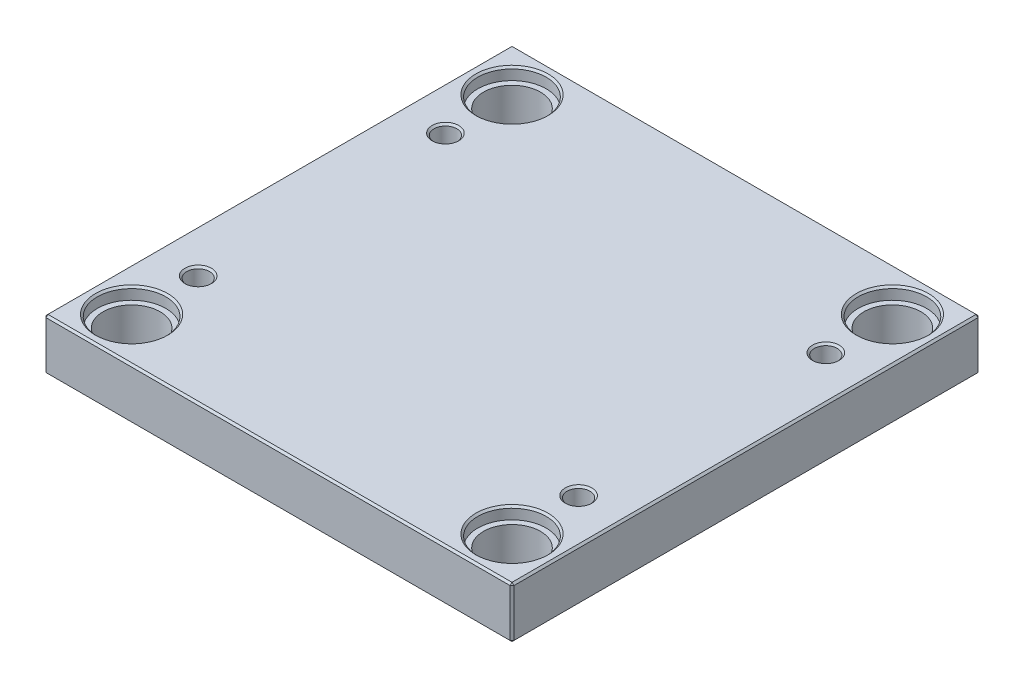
ISO-10303-21;
HEADER;
FILE_DESCRIPTION(('STEP AP214'),'2;1');
FILE_NAME('part.step','',(''),(''),'','','');
FILE_SCHEMA(('AUTOMOTIVE_DESIGN { 1 0 10303 214 1 1 1 1 }'));
ENDSEC;
DATA;
#1=APPLICATION_CONTEXT('core data for automotive mechanical design processes');
#2=APPLICATION_PROTOCOL_DEFINITION('international standard','automotive_design',2000,#1);
#3=PRODUCT_CONTEXT('',#1,'mechanical');
#4=PRODUCT('Part','Part','',(#3));
#5=PRODUCT_RELATED_PRODUCT_CATEGORY('part','',(#4));
#6=PRODUCT_DEFINITION_FORMATION('','',#4);
#7=PRODUCT_DEFINITION_CONTEXT('part definition',#1,'design');
#8=PRODUCT_DEFINITION('design','',#6,#7);
#9=PRODUCT_DEFINITION_SHAPE('','',#8);
#10=(LENGTH_UNIT() NAMED_UNIT(*) SI_UNIT(.MILLI.,.METRE.));
#11=(NAMED_UNIT(*) PLANE_ANGLE_UNIT() SI_UNIT($,.RADIAN.));
#12=(NAMED_UNIT(*) SI_UNIT($,.STERADIAN.) SOLID_ANGLE_UNIT());
#13=UNCERTAINTY_MEASURE_WITH_UNIT(LENGTH_MEASURE(1.E-05),#10,'distance_accuracy_value','');
#14=(GEOMETRIC_REPRESENTATION_CONTEXT(3) GLOBAL_UNCERTAINTY_ASSIGNED_CONTEXT((#13)) GLOBAL_UNIT_ASSIGNED_CONTEXT((#10,
#11,#12)) REPRESENTATION_CONTEXT('',''));
#15=CARTESIAN_POINT('',(0.,0.,0.));
#16=DIRECTION('',(0.,0.,1.));
#17=DIRECTION('',(1.,0.,0.));
#18=AXIS2_PLACEMENT_3D('',#15,#16,#17);
#19=CARTESIAN_POINT('',(-100.,0.,-100.));
#20=DIRECTION('',(0.,1.,0.));
#21=DIRECTION('',(0.,0.,1.));
#22=AXIS2_PLACEMENT_3D('',#19,#20,#21);
#23=CYLINDRICAL_SURFACE('',#22,15.);
#24=CARTESIAN_POINT('',(-100.,1.,-100.));
#25=DIRECTION('',(0.,1.,0.));
#26=DIRECTION('',(0.,0.,1.));
#27=AXIS2_PLACEMENT_3D('',#24,#25,#26);
#28=CIRCLE('',#27,15.);
#29=CARTESIAN_POINT('',(-100.,1.,-85.));
#30=VERTEX_POINT('',#29);
#31=EDGE_CURVE('E472',#30,#30,#28,.F.);
#32=ORIENTED_EDGE('',*,*,#31,.T.);
#33=EDGE_LOOP('',(#32));
#34=FACE_BOUND('',#33,.T.);
#35=CARTESIAN_POINT('',(-100.,20.7,-100.));
#36=DIRECTION('',(0.,1.,0.));
#37=DIRECTION('',(0.,0.,1.));
#38=AXIS2_PLACEMENT_3D('',#35,#36,#37);
#39=CIRCLE('',#38,15.);
#40=CARTESIAN_POINT('',(-100.,20.7,-85.));
#41=VERTEX_POINT('',#40);
#42=EDGE_CURVE('E221',#41,#41,#39,.F.);
#43=ORIENTED_EDGE('',*,*,#42,.F.);
#44=EDGE_LOOP('',(#43));
#45=FACE_BOUND('',#44,.T.);
#46=ADVANCED_FACE('F16',(#34,#45),#23,.F.);
#47=CARTESIAN_POINT('',(100.,0.,-100.));
#48=DIRECTION('',(0.,1.,0.));
#49=DIRECTION('',(0.,0.,1.));
#50=AXIS2_PLACEMENT_3D('',#47,#48,#49);
#51=CYLINDRICAL_SURFACE('',#50,15.);
#52=CARTESIAN_POINT('',(100.,1.,-100.));
#53=DIRECTION('',(0.,1.,0.));
#54=DIRECTION('',(0.,0.,1.));
#55=AXIS2_PLACEMENT_3D('',#52,#53,#54);
#56=CIRCLE('',#55,15.);
#57=CARTESIAN_POINT('',(100.,1.,-85.));
#58=VERTEX_POINT('',#57);
#59=EDGE_CURVE('E474',#58,#58,#56,.F.);
#60=ORIENTED_EDGE('',*,*,#59,.T.);
#61=EDGE_LOOP('',(#60));
#62=FACE_BOUND('',#61,.T.);
#63=CARTESIAN_POINT('',(100.,20.7,-100.));
#64=DIRECTION('',(0.,1.,0.));
#65=DIRECTION('',(0.,0.,1.));
#66=AXIS2_PLACEMENT_3D('',#63,#64,#65);
#67=CIRCLE('',#66,15.);
#68=CARTESIAN_POINT('',(100.,20.7,-85.));
#69=VERTEX_POINT('',#68);
#70=EDGE_CURVE('E218',#69,#69,#67,.F.);
#71=ORIENTED_EDGE('',*,*,#70,.F.);
#72=EDGE_LOOP('',(#71));
#73=FACE_BOUND('',#72,.T.);
#74=ADVANCED_FACE('F263',(#62,#73),#51,.F.);
#75=CARTESIAN_POINT('',(100.,0.,100.));
#76=DIRECTION('',(0.,1.,0.));
#77=DIRECTION('',(0.,0.,1.));
#78=AXIS2_PLACEMENT_3D('',#75,#76,#77);
#79=CYLINDRICAL_SURFACE('',#78,15.);
#80=CARTESIAN_POINT('',(100.,1.,100.));
#81=DIRECTION('',(0.,1.,0.));
#82=DIRECTION('',(0.,0.,1.));
#83=AXIS2_PLACEMENT_3D('',#80,#81,#82);
#84=CIRCLE('',#83,15.);
#85=CARTESIAN_POINT('',(100.,1.,115.));
#86=VERTEX_POINT('',#85);
#87=EDGE_CURVE('E477',#86,#86,#84,.F.);
#88=ORIENTED_EDGE('',*,*,#87,.T.);
#89=EDGE_LOOP('',(#88));
#90=FACE_BOUND('',#89,.T.);
#91=CARTESIAN_POINT('',(100.,20.7,100.));
#92=DIRECTION('',(0.,1.,0.));
#93=DIRECTION('',(0.,0.,1.));
#94=AXIS2_PLACEMENT_3D('',#91,#92,#93);
#95=CIRCLE('',#94,15.);
#96=CARTESIAN_POINT('',(100.,20.7,115.));
#97=VERTEX_POINT('',#96);
#98=EDGE_CURVE('E214',#97,#97,#95,.F.);
#99=ORIENTED_EDGE('',*,*,#98,.F.);
#100=EDGE_LOOP('',(#99));
#101=FACE_BOUND('',#100,.T.);
#102=ADVANCED_FACE('F270',(#90,#101),#79,.F.);
#103=CARTESIAN_POINT('',(-100.,0.,100.));
#104=DIRECTION('',(0.,1.,0.));
#105=DIRECTION('',(0.,0.,1.));
#106=AXIS2_PLACEMENT_3D('',#103,#104,#105);
#107=CYLINDRICAL_SURFACE('',#106,15.);
#108=CARTESIAN_POINT('',(-100.,1.,100.));
#109=DIRECTION('',(0.,1.,0.));
#110=DIRECTION('',(0.,0.,1.));
#111=AXIS2_PLACEMENT_3D('',#108,#109,#110);
#112=CIRCLE('',#111,15.);
#113=CARTESIAN_POINT('',(-100.,1.,115.));
#114=VERTEX_POINT('',#113);
#115=EDGE_CURVE('E480',#114,#114,#112,.F.);
#116=ORIENTED_EDGE('',*,*,#115,.T.);
#117=EDGE_LOOP('',(#116));
#118=FACE_BOUND('',#117,.T.);
#119=CARTESIAN_POINT('',(-100.,20.7,100.));
#120=DIRECTION('',(0.,1.,0.));
#121=DIRECTION('',(0.,0.,1.));
#122=AXIS2_PLACEMENT_3D('',#119,#120,#121);
#123=CIRCLE('',#122,15.);
#124=CARTESIAN_POINT('',(-100.,20.7,115.));
#125=VERTEX_POINT('',#124);
#126=EDGE_CURVE('E211',#125,#125,#123,.F.);
#127=ORIENTED_EDGE('',*,*,#126,.F.);
#128=EDGE_LOOP('',(#127));
#129=FACE_BOUND('',#128,.T.);
#130=ADVANCED_FACE('F277',(#118,#129),#107,.F.);
#131=CARTESIAN_POINT('',(-123.,27.,123.));
#132=DIRECTION('',(1.,0.,0.));
#133=DIRECTION('',(0.,0.,-1.));
#134=AXIS2_PLACEMENT_3D('',#131,#132,#133);
#135=PLANE('',#134);
#136=DIRECTION('',(0.,-1.,0.));
#137=VECTOR('',#136,1.);
#138=CARTESIAN_POINT('',(-123.,27.,-122.));
#139=LINE('',#138,#137);
#140=CARTESIAN_POINT('',(-123.,26.,-122.));
#141=VERTEX_POINT('',#140);
#142=CARTESIAN_POINT('',(-123.,1.,-122.));
#143=VERTEX_POINT('',#142);
#144=EDGE_CURVE('E487',#141,#143,#139,.T.);
#145=ORIENTED_EDGE('',*,*,#144,.T.);
#146=DIRECTION('',(0.,0.,1.));
#147=VECTOR('',#146,1.);
#148=CARTESIAN_POINT('',(-123.,1.,123.));
#149=LINE('',#148,#147);
#150=CARTESIAN_POINT('',(-123.,1.,122.));
#151=VERTEX_POINT('',#150);
#152=EDGE_CURVE('E490',#143,#151,#149,.T.);
#153=ORIENTED_EDGE('',*,*,#152,.T.);
#154=DIRECTION('',(0.,1.,0.));
#155=VECTOR('',#154,1.);
#156=CARTESIAN_POINT('',(-123.,27.,122.));
#157=LINE('',#156,#155);
#158=CARTESIAN_POINT('',(-123.,26.,122.));
#159=VERTEX_POINT('',#158);
#160=EDGE_CURVE('E485',#151,#159,#157,.T.);
#161=ORIENTED_EDGE('',*,*,#160,.T.);
#162=DIRECTION('',(0.,0.,-1.));
#163=VECTOR('',#162,1.);
#164=CARTESIAN_POINT('',(-123.,26.,-123.));
#165=LINE('',#164,#163);
#166=EDGE_CURVE('E483',#159,#141,#165,.T.);
#167=ORIENTED_EDGE('',*,*,#166,.T.);
#168=EDGE_LOOP('',(#145,#153,#161,#167));
#169=FACE_BOUND('',#168,.T.);
#170=ADVANCED_FACE('F298',(#169),#135,.F.);
#171=CARTESIAN_POINT('',(123.,27.,123.));
#172=DIRECTION('',(0.,0.,-1.));
#173=DIRECTION('',(-1.,0.,0.));
#174=AXIS2_PLACEMENT_3D('',#171,#172,#173);
#175=PLANE('',#174);
#176=DIRECTION('',(-1.,0.,0.));
#177=VECTOR('',#176,1.);
#178=CARTESIAN_POINT('',(-123.,26.,123.));
#179=LINE('',#178,#177);
#180=CARTESIAN_POINT('',(122.,26.,123.));
#181=VERTEX_POINT('',#180);
#182=CARTESIAN_POINT('',(-122.,26.,123.));
#183=VERTEX_POINT('',#182);
#184=EDGE_CURVE('E509',#181,#183,#179,.T.);
#185=ORIENTED_EDGE('',*,*,#184,.T.);
#186=DIRECTION('',(0.,-1.,0.));
#187=VECTOR('',#186,1.);
#188=CARTESIAN_POINT('',(-122.,27.,123.));
#189=LINE('',#188,#187);
#190=CARTESIAN_POINT('',(-122.,1.,123.));
#191=VERTEX_POINT('',#190);
#192=EDGE_CURVE('E515',#183,#191,#189,.T.);
#193=ORIENTED_EDGE('',*,*,#192,.T.);
#194=DIRECTION('',(1.,0.,0.));
#195=VECTOR('',#194,1.);
#196=CARTESIAN_POINT('',(123.,1.,123.));
#197=LINE('',#196,#195);
#198=CARTESIAN_POINT('',(122.,1.,123.));
#199=VERTEX_POINT('',#198);
#200=EDGE_CURVE('E513',#191,#199,#197,.T.);
#201=ORIENTED_EDGE('',*,*,#200,.T.);
#202=DIRECTION('',(0.,1.,0.));
#203=VECTOR('',#202,1.);
#204=CARTESIAN_POINT('',(122.,27.,123.));
#205=LINE('',#204,#203);
#206=EDGE_CURVE('E511',#199,#181,#205,.T.);
#207=ORIENTED_EDGE('',*,*,#206,.T.);
#208=EDGE_LOOP('',(#185,#193,#201,#207));
#209=FACE_BOUND('',#208,.T.);
#210=ADVANCED_FACE('F294',(#209),#175,.F.);
#211=CARTESIAN_POINT('',(123.,27.,123.));
#212=DIRECTION('',(-1.,0.,0.));
#213=DIRECTION('',(0.,0.,1.));
#214=AXIS2_PLACEMENT_3D('',#211,#212,#213);
#215=PLANE('',#214);
#216=DIRECTION('',(0.,0.,-1.));
#217=VECTOR('',#216,1.);
#218=CARTESIAN_POINT('',(123.,1.,123.));
#219=LINE('',#218,#217);
#220=CARTESIAN_POINT('',(123.,1.,122.));
#221=VERTEX_POINT('',#220);
#222=CARTESIAN_POINT('',(123.,1.,-122.));
#223=VERTEX_POINT('',#222);
#224=EDGE_CURVE('E504',#221,#223,#219,.T.);
#225=ORIENTED_EDGE('',*,*,#224,.T.);
#226=DIRECTION('',(0.,1.,0.));
#227=VECTOR('',#226,1.);
#228=CARTESIAN_POINT('',(123.,27.,-122.));
#229=LINE('',#228,#227);
#230=CARTESIAN_POINT('',(123.,26.,-122.));
#231=VERTEX_POINT('',#230);
#232=EDGE_CURVE('E506',#223,#231,#229,.T.);
#233=ORIENTED_EDGE('',*,*,#232,.T.);
#234=DIRECTION('',(0.,0.,1.));
#235=VECTOR('',#234,1.);
#236=CARTESIAN_POINT('',(123.,26.,123.));
#237=LINE('',#236,#235);
#238=CARTESIAN_POINT('',(123.,26.,122.));
#239=VERTEX_POINT('',#238);
#240=EDGE_CURVE('E500',#231,#239,#237,.T.);
#241=ORIENTED_EDGE('',*,*,#240,.T.);
#242=DIRECTION('',(0.,-1.,0.));
#243=VECTOR('',#242,1.);
#244=CARTESIAN_POINT('',(123.,27.,122.));
#245=LINE('',#244,#243);
#246=EDGE_CURVE('E502',#239,#221,#245,.T.);
#247=ORIENTED_EDGE('',*,*,#246,.T.);
#248=EDGE_LOOP('',(#225,#233,#241,#247));
#249=FACE_BOUND('',#248,.T.);
#250=ADVANCED_FACE('F290',(#249),#215,.F.);
#251=CARTESIAN_POINT('',(123.,27.,-123.));
#252=DIRECTION('',(0.,0.,1.));
#253=DIRECTION('',(1.,0.,0.));
#254=AXIS2_PLACEMENT_3D('',#251,#252,#253);
#255=PLANE('',#254);
#256=DIRECTION('',(0.,-1.,0.));
#257=VECTOR('',#256,1.);
#258=CARTESIAN_POINT('',(122.,27.,-123.));
#259=LINE('',#258,#257);
#260=CARTESIAN_POINT('',(122.,26.,-123.));
#261=VERTEX_POINT('',#260);
#262=CARTESIAN_POINT('',(122.,1.,-123.));
#263=VERTEX_POINT('',#262);
#264=EDGE_CURVE('E494',#261,#263,#259,.T.);
#265=ORIENTED_EDGE('',*,*,#264,.T.);
#266=DIRECTION('',(-1.,0.,0.));
#267=VECTOR('',#266,1.);
#268=CARTESIAN_POINT('',(123.,1.,-123.));
#269=LINE('',#268,#267);
#270=CARTESIAN_POINT('',(-122.,1.,-123.));
#271=VERTEX_POINT('',#270);
#272=EDGE_CURVE('E138',#263,#271,#269,.T.);
#273=ORIENTED_EDGE('',*,*,#272,.T.);
#274=DIRECTION('',(0.,1.,0.));
#275=VECTOR('',#274,1.);
#276=CARTESIAN_POINT('',(-122.,27.,-123.));
#277=LINE('',#276,#275);
#278=CARTESIAN_POINT('',(-122.,26.,-123.));
#279=VERTEX_POINT('',#278);
#280=EDGE_CURVE('E496',#271,#279,#277,.T.);
#281=ORIENTED_EDGE('',*,*,#280,.T.);
#282=DIRECTION('',(1.,0.,0.));
#283=VECTOR('',#282,1.);
#284=CARTESIAN_POINT('',(123.,26.,-123.));
#285=LINE('',#284,#283);
#286=EDGE_CURVE('E492',#279,#261,#285,.T.);
#287=ORIENTED_EDGE('',*,*,#286,.T.);
#288=EDGE_LOOP('',(#265,#273,#281,#287));
#289=FACE_BOUND('',#288,.T.);
#290=ADVANCED_FACE('F282',(#289),#255,.F.);
#291=CARTESIAN_POINT('',(0.,27.,0.));
#292=DIRECTION('',(0.,1.,0.));
#293=DIRECTION('',(0.,0.,1.));
#294=AXIS2_PLACEMENT_3D('',#291,#292,#293);
#295=PLANE('',#294);
#296=CARTESIAN_POINT('',(100.,27.,100.));
#297=DIRECTION('',(0.,1.,0.));
#298=DIRECTION('',(0.,0.,1.));
#299=AXIS2_PLACEMENT_3D('',#296,#297,#298);
#300=CIRCLE('',#299,19.);
#301=CARTESIAN_POINT('',(100.,27.,119.));
#302=VERTEX_POINT('',#301);
#303=EDGE_CURVE('E236',#302,#302,#300,.F.);
#304=ORIENTED_EDGE('',*,*,#303,.T.);
#305=EDGE_LOOP('',(#304));
#306=FACE_BOUND('',#305,.T.);
#307=CARTESIAN_POINT('',(-100.,27.,100.));
#308=DIRECTION('',(0.,1.,0.));
#309=DIRECTION('',(0.,0.,1.));
#310=AXIS2_PLACEMENT_3D('',#307,#308,#309);
#311=CIRCLE('',#310,19.);
#312=CARTESIAN_POINT('',(-100.,27.,119.));
#313=VERTEX_POINT('',#312);
#314=EDGE_CURVE('E233',#313,#313,#311,.F.);
#315=ORIENTED_EDGE('',*,*,#314,.T.);
#316=EDGE_LOOP('',(#315));
#317=FACE_BOUND('',#316,.T.);
#318=CARTESIAN_POINT('',(100.,27.,-100.));
#319=DIRECTION('',(0.,1.,0.));
#320=DIRECTION('',(0.,0.,1.));
#321=AXIS2_PLACEMENT_3D('',#318,#319,#320);
#322=CIRCLE('',#321,19.);
#323=CARTESIAN_POINT('',(100.,27.,-81.));
#324=VERTEX_POINT('',#323);
#325=EDGE_CURVE('E230',#324,#324,#322,.F.);
#326=ORIENTED_EDGE('',*,*,#325,.T.);
#327=EDGE_LOOP('',(#326));
#328=FACE_BOUND('',#327,.T.);
#329=CARTESIAN_POINT('',(-100.,27.,-100.));
#330=DIRECTION('',(0.,1.,0.));
#331=DIRECTION('',(0.,0.,1.));
#332=AXIS2_PLACEMENT_3D('',#329,#330,#331);
#333=CIRCLE('',#332,19.);
#334=CARTESIAN_POINT('',(-100.,27.,-81.));
#335=VERTEX_POINT('',#334);
#336=EDGE_CURVE('E227',#335,#335,#333,.F.);
#337=ORIENTED_EDGE('',*,*,#336,.T.);
#338=EDGE_LOOP('',(#337));
#339=FACE_BOUND('',#338,.T.);
#340=CARTESIAN_POINT('',(-100.,27.,65.));
#341=DIRECTION('',(0.,1.,0.));
#342=DIRECTION('',(0.,0.,1.));
#343=AXIS2_PLACEMENT_3D('',#340,#341,#342);
#344=CIRCLE('',#343,7.);
#345=CARTESIAN_POINT('',(-100.,27.,72.));
#346=VERTEX_POINT('',#345);
#347=EDGE_CURVE('E198',#346,#346,#344,.F.);
#348=ORIENTED_EDGE('',*,*,#347,.T.);
#349=EDGE_LOOP('',(#348));
#350=FACE_BOUND('',#349,.T.);
#351=CARTESIAN_POINT('',(100.,27.,65.));
#352=DIRECTION('',(0.,1.,0.));
#353=DIRECTION('',(0.,0.,1.));
#354=AXIS2_PLACEMENT_3D('',#351,#352,#353);
#355=CIRCLE('',#354,7.00000000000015);
#356=CARTESIAN_POINT('',(100.,27.,72.0000000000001));
#357=VERTEX_POINT('',#356);
#358=EDGE_CURVE('E195',#357,#357,#355,.F.);
#359=ORIENTED_EDGE('',*,*,#358,.T.);
#360=EDGE_LOOP('',(#359));
#361=FACE_BOUND('',#360,.T.);
#362=CARTESIAN_POINT('',(100.,27.,-65.));
#363=DIRECTION('',(0.,1.,0.));
#364=DIRECTION('',(0.,0.,1.));
#365=AXIS2_PLACEMENT_3D('',#362,#363,#364);
#366=CIRCLE('',#365,7.00000000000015);
#367=CARTESIAN_POINT('',(100.,27.,-57.9999999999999));
#368=VERTEX_POINT('',#367);
#369=EDGE_CURVE('E192',#368,#368,#366,.F.);
#370=ORIENTED_EDGE('',*,*,#369,.T.);
#371=EDGE_LOOP('',(#370));
#372=FACE_BOUND('',#371,.T.);
#373=CARTESIAN_POINT('',(-100.,27.,-65.));
#374=DIRECTION('',(0.,1.,0.));
#375=DIRECTION('',(0.,0.,1.));
#376=AXIS2_PLACEMENT_3D('',#373,#374,#375);
#377=CIRCLE('',#376,7.);
#378=CARTESIAN_POINT('',(-100.,27.,-58.));
#379=VERTEX_POINT('',#378);
#380=EDGE_CURVE('E188',#379,#379,#377,.F.);
#381=ORIENTED_EDGE('',*,*,#380,.T.);
#382=EDGE_LOOP('',(#381));
#383=FACE_BOUND('',#382,.T.);
#384=DIRECTION('',(0.,0.,-1.));
#385=VECTOR('',#384,1.);
#386=CARTESIAN_POINT('',(122.,27.,-123.));
#387=LINE('',#386,#385);
#388=CARTESIAN_POINT('',(122.,27.,122.));
#389=VERTEX_POINT('',#388);
#390=CARTESIAN_POINT('',(122.,27.,-122.));
#391=VERTEX_POINT('',#390);
#392=EDGE_CURVE('E31',#389,#391,#387,.T.);
#393=ORIENTED_EDGE('',*,*,#392,.T.);
#394=DIRECTION('',(-1.,0.,0.));
#395=VECTOR('',#394,1.);
#396=CARTESIAN_POINT('',(-123.,27.,-122.));
#397=LINE('',#396,#395);
#398=CARTESIAN_POINT('',(-122.,27.,-122.));
#399=VERTEX_POINT('',#398);
#400=EDGE_CURVE('E189',#391,#399,#397,.T.);
#401=ORIENTED_EDGE('',*,*,#400,.T.);
#402=DIRECTION('',(0.,0.,1.));
#403=VECTOR('',#402,1.);
#404=CARTESIAN_POINT('',(-122.,27.,123.));
#405=LINE('',#404,#403);
#406=CARTESIAN_POINT('',(-122.,27.,122.));
#407=VERTEX_POINT('',#406);
#408=EDGE_CURVE('E518',#399,#407,#405,.T.);
#409=ORIENTED_EDGE('',*,*,#408,.T.);
#410=DIRECTION('',(1.,0.,0.));
#411=VECTOR('',#410,1.);
#412=CARTESIAN_POINT('',(123.,27.,122.));
#413=LINE('',#412,#411);
#414=EDGE_CURVE('E36',#407,#389,#413,.T.);
#415=ORIENTED_EDGE('',*,*,#414,.T.);
#416=EDGE_LOOP('',(#393,#401,#409,#415));
#417=FACE_BOUND('',#416,.T.);
#418=ADVANCED_FACE('F279',(#306,#317,#328,#339,#350,#361,#372,#383,#417),#295,.T.);
#419=CARTESIAN_POINT('',(0.,0.,0.));
#420=DIRECTION('',(0.,1.,0.));
#421=DIRECTION('',(0.,0.,1.));
#422=AXIS2_PLACEMENT_3D('',#419,#420,#421);
#423=PLANE('',#422);
#424=CARTESIAN_POINT('',(-100.,0.,-100.));
#425=DIRECTION('',(0.,1.,0.));
#426=DIRECTION('',(0.,0.,1.));
#427=AXIS2_PLACEMENT_3D('',#424,#425,#426);
#428=CIRCLE('',#427,16.);
#429=CARTESIAN_POINT('',(-100.,0.,-84.));
#430=VERTEX_POINT('',#429);
#431=EDGE_CURVE('E469',#430,#430,#428,.T.);
#432=ORIENTED_EDGE('',*,*,#431,.T.);
#433=EDGE_LOOP('',(#432));
#434=FACE_BOUND('',#433,.T.);
#435=CARTESIAN_POINT('',(100.,0.,-100.));
#436=DIRECTION('',(0.,1.,0.));
#437=DIRECTION('',(0.,0.,1.));
#438=AXIS2_PLACEMENT_3D('',#435,#436,#437);
#439=CIRCLE('',#438,16.);
#440=CARTESIAN_POINT('',(100.,0.,-84.));
#441=VERTEX_POINT('',#440);
#442=EDGE_CURVE('E466',#441,#441,#439,.T.);
#443=ORIENTED_EDGE('',*,*,#442,.T.);
#444=EDGE_LOOP('',(#443));
#445=FACE_BOUND('',#444,.T.);
#446=CARTESIAN_POINT('',(100.,0.,100.));
#447=DIRECTION('',(0.,1.,0.));
#448=DIRECTION('',(0.,0.,1.));
#449=AXIS2_PLACEMENT_3D('',#446,#447,#448);
#450=CIRCLE('',#449,16.);
#451=CARTESIAN_POINT('',(100.,0.,116.));
#452=VERTEX_POINT('',#451);
#453=EDGE_CURVE('E463',#452,#452,#450,.T.);
#454=ORIENTED_EDGE('',*,*,#453,.T.);
#455=EDGE_LOOP('',(#454));
#456=FACE_BOUND('',#455,.T.);
#457=CARTESIAN_POINT('',(-100.,0.,100.));
#458=DIRECTION('',(0.,1.,0.));
#459=DIRECTION('',(0.,0.,1.));
#460=AXIS2_PLACEMENT_3D('',#457,#458,#459);
#461=CIRCLE('',#460,16.);
#462=CARTESIAN_POINT('',(-100.,0.,116.));
#463=VERTEX_POINT('',#462);
#464=EDGE_CURVE('E460',#463,#463,#461,.T.);
#465=ORIENTED_EDGE('',*,*,#464,.T.);
#466=EDGE_LOOP('',(#465));
#467=FACE_BOUND('',#466,.T.);
#468=DIRECTION('',(0.,0.,1.));
#469=VECTOR('',#468,1.);
#470=CARTESIAN_POINT('',(122.,0.,0.));
#471=LINE('',#470,#469);
#472=CARTESIAN_POINT('',(122.,0.,-122.));
#473=VERTEX_POINT('',#472);
#474=CARTESIAN_POINT('',(122.,0.,122.));
#475=VERTEX_POINT('',#474);
#476=EDGE_CURVE('E108',#473,#475,#471,.T.);
#477=ORIENTED_EDGE('',*,*,#476,.T.);
#478=DIRECTION('',(-1.,0.,0.));
#479=VECTOR('',#478,1.);
#480=CARTESIAN_POINT('',(0.,0.,122.));
#481=LINE('',#480,#479);
#482=CARTESIAN_POINT('',(-122.,0.,122.));
#483=VERTEX_POINT('',#482);
#484=EDGE_CURVE('E458',#475,#483,#481,.T.);
#485=ORIENTED_EDGE('',*,*,#484,.T.);
#486=DIRECTION('',(0.,0.,-1.));
#487=VECTOR('',#486,1.);
#488=CARTESIAN_POINT('',(-122.,0.,0.));
#489=LINE('',#488,#487);
#490=CARTESIAN_POINT('',(-122.,0.,-122.));
#491=VERTEX_POINT('',#490);
#492=EDGE_CURVE('E110',#483,#491,#489,.T.);
#493=ORIENTED_EDGE('',*,*,#492,.T.);
#494=DIRECTION('',(1.,0.,0.));
#495=VECTOR('',#494,1.);
#496=CARTESIAN_POINT('',(0.,0.,-122.));
#497=LINE('',#496,#495);
#498=EDGE_CURVE('E104',#491,#473,#497,.T.);
#499=ORIENTED_EDGE('',*,*,#498,.T.);
#500=EDGE_LOOP('',(#477,#485,#493,#499));
#501=FACE_BOUND('',#500,.T.);
#502=ADVANCED_FACE('F106',(#434,#445,#456,#467,#501),#423,.F.);
#503=CARTESIAN_POINT('',(-100.,0.,-100.));
#504=DIRECTION('',(0.,-1.,0.));
#505=DIRECTION('',(0.,0.,-1.));
#506=AXIS2_PLACEMENT_3D('',#503,#504,#505);
#507=CONICAL_SURFACE('',#506,16.,0.785398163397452);
#508=ORIENTED_EDGE('',*,*,#31,.F.);
#509=EDGE_LOOP('',(#508));
#510=FACE_BOUND('',#509,.T.);
#511=ORIENTED_EDGE('',*,*,#431,.F.);
#512=EDGE_LOOP('',(#511));
#513=FACE_BOUND('',#512,.T.);
#514=ADVANCED_FACE('F286',(#510,#513),#507,.F.);
#515=CARTESIAN_POINT('',(100.,0.,-100.));
#516=DIRECTION('',(0.,-1.,0.));
#517=DIRECTION('',(0.,0.,-1.));
#518=AXIS2_PLACEMENT_3D('',#515,#516,#517);
#519=CONICAL_SURFACE('',#518,16.,0.785398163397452);
#520=ORIENTED_EDGE('',*,*,#59,.F.);
#521=EDGE_LOOP('',(#520));
#522=FACE_BOUND('',#521,.T.);
#523=ORIENTED_EDGE('',*,*,#442,.F.);
#524=EDGE_LOOP('',(#523));
#525=FACE_BOUND('',#524,.T.);
#526=ADVANCED_FACE('F305',(#522,#525),#519,.F.);
#527=CARTESIAN_POINT('',(100.,0.,100.));
#528=DIRECTION('',(0.,-1.,0.));
#529=DIRECTION('',(0.,0.,-1.));
#530=AXIS2_PLACEMENT_3D('',#527,#528,#529);
#531=CONICAL_SURFACE('',#530,16.,0.785398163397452);
#532=ORIENTED_EDGE('',*,*,#87,.F.);
#533=EDGE_LOOP('',(#532));
#534=FACE_BOUND('',#533,.T.);
#535=ORIENTED_EDGE('',*,*,#453,.F.);
#536=EDGE_LOOP('',(#535));
#537=FACE_BOUND('',#536,.T.);
#538=ADVANCED_FACE('F309',(#534,#537),#531,.F.);
#539=CARTESIAN_POINT('',(-100.,0.,100.));
#540=DIRECTION('',(0.,-1.,0.));
#541=DIRECTION('',(0.,0.,-1.));
#542=AXIS2_PLACEMENT_3D('',#539,#540,#541);
#543=CONICAL_SURFACE('',#542,16.,0.785398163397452);
#544=ORIENTED_EDGE('',*,*,#115,.F.);
#545=EDGE_LOOP('',(#544));
#546=FACE_BOUND('',#545,.T.);
#547=ORIENTED_EDGE('',*,*,#464,.F.);
#548=EDGE_LOOP('',(#547));
#549=FACE_BOUND('',#548,.T.);
#550=ADVANCED_FACE('F313',(#546,#549),#543,.F.);
#551=CARTESIAN_POINT('',(123.,27.,122.));
#552=DIRECTION('',(-0.707106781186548,0.,-0.707106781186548));
#553=DIRECTION('',(0.,-1.,0.));
#554=AXIS2_PLACEMENT_3D('',#551,#552,#553);
#555=PLANE('',#554);
#556=DIRECTION('',(-0.707106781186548,0.,0.707106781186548));
#557=VECTOR('',#556,1.);
#558=CARTESIAN_POINT('',(122.,26.,123.));
#559=LINE('',#558,#557);
#560=EDGE_CURVE('E126',#181,#239,#559,.F.);
#561=ORIENTED_EDGE('',*,*,#560,.F.);
#562=ORIENTED_EDGE('',*,*,#206,.F.);
#563=DIRECTION('',(0.707106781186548,0.,-0.707106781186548));
#564=VECTOR('',#563,1.);
#565=CARTESIAN_POINT('',(122.,1.,123.));
#566=LINE('',#565,#564);
#567=EDGE_CURVE('E180',#221,#199,#566,.F.);
#568=ORIENTED_EDGE('',*,*,#567,.F.);
#569=ORIENTED_EDGE('',*,*,#246,.F.);
#570=EDGE_LOOP('',(#561,#562,#568,#569));
#571=FACE_BOUND('',#570,.T.);
#572=ADVANCED_FACE('F317',(#571),#555,.F.);
#573=CARTESIAN_POINT('',(122.,26.,123.));
#574=DIRECTION('',(0.577350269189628,0.57735026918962,0.577350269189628));
#575=DIRECTION('',(0.707106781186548,0.,-0.707106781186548));
#576=AXIS2_PLACEMENT_3D('',#573,#574,#575);
#577=PLANE('',#576);
#578=DIRECTION('',(0.,-0.70710678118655,0.707106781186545));
#579=VECTOR('',#578,1.);
#580=CARTESIAN_POINT('',(122.,26.,123.));
#581=LINE('',#580,#579);
#582=EDGE_CURVE('E175',#181,#389,#581,.F.);
#583=ORIENTED_EDGE('',*,*,#582,.F.);
#584=ORIENTED_EDGE('',*,*,#560,.T.);
#585=DIRECTION('',(-0.707106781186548,0.707106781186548,0.));
#586=VECTOR('',#585,1.);
#587=CARTESIAN_POINT('',(122.5,26.5,122.));
#588=LINE('',#587,#586);
#589=EDGE_CURVE('E177',#389,#239,#588,.F.);
#590=ORIENTED_EDGE('',*,*,#589,.F.);
#591=EDGE_LOOP('',(#583,#584,#590));
#592=FACE_BOUND('',#591,.T.);
#593=ADVANCED_FACE('F385',(#592),#577,.T.);
#594=CARTESIAN_POINT('',(122.,1.,123.));
#595=DIRECTION('',(0.577350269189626,-0.577350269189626,0.577350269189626));
#596=DIRECTION('',(0.707106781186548,0.,-0.707106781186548));
#597=AXIS2_PLACEMENT_3D('',#594,#595,#596);
#598=PLANE('',#597);
#599=DIRECTION('',(-0.707106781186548,-0.707106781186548,0.));
#600=VECTOR('',#599,1.);
#601=CARTESIAN_POINT('',(122.5,0.5,122.));
#602=LINE('',#601,#600);
#603=EDGE_CURVE('E124',#221,#475,#602,.T.);
#604=ORIENTED_EDGE('',*,*,#603,.F.);
#605=ORIENTED_EDGE('',*,*,#567,.T.);
#606=DIRECTION('',(0.,0.70710678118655,0.707106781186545));
#607=VECTOR('',#606,1.);
#608=CARTESIAN_POINT('',(122.,1.,123.));
#609=LINE('',#608,#607);
#610=EDGE_CURVE('E172',#475,#199,#609,.T.);
#611=ORIENTED_EDGE('',*,*,#610,.F.);
#612=EDGE_LOOP('',(#604,#605,#611));
#613=FACE_BOUND('',#612,.T.);
#614=ADVANCED_FACE('F381',(#613),#598,.T.);
#615=CARTESIAN_POINT('',(122.,27.,0.));
#616=DIRECTION('',(0.707106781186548,0.707106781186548,0.));
#617=DIRECTION('',(0.,0.,1.));
#618=AXIS2_PLACEMENT_3D('',#615,#616,#617);
#619=PLANE('',#618);
#620=ORIENTED_EDGE('',*,*,#589,.T.);
#621=ORIENTED_EDGE('',*,*,#240,.F.);
#622=DIRECTION('',(0.707106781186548,-0.707106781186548,0.));
#623=VECTOR('',#622,1.);
#624=CARTESIAN_POINT('',(123.,26.,-122.));
#625=LINE('',#624,#623);
#626=EDGE_CURVE('E166',#391,#231,#625,.T.);
#627=ORIENTED_EDGE('',*,*,#626,.F.);
#628=ORIENTED_EDGE('',*,*,#392,.F.);
#629=EDGE_LOOP('',(#620,#621,#627,#628));
#630=FACE_BOUND('',#629,.T.);
#631=ADVANCED_FACE('F377',(#630),#619,.T.);
#632=CARTESIAN_POINT('',(0.,27.,122.));
#633=DIRECTION('',(0.,0.707106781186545,0.70710678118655));
#634=DIRECTION('',(-1.,0.,0.));
#635=AXIS2_PLACEMENT_3D('',#632,#633,#634);
#636=PLANE('',#635);
#637=ORIENTED_EDGE('',*,*,#582,.T.);
#638=ORIENTED_EDGE('',*,*,#414,.F.);
#639=DIRECTION('',(0.,0.70710678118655,-0.707106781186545));
#640=VECTOR('',#639,1.);
#641=CARTESIAN_POINT('',(-122.,26.5,122.5));
#642=LINE('',#641,#640);
#643=EDGE_CURVE('E163',#183,#407,#642,.T.);
#644=ORIENTED_EDGE('',*,*,#643,.F.);
#645=ORIENTED_EDGE('',*,*,#184,.F.);
#646=EDGE_LOOP('',(#637,#638,#644,#645));
#647=FACE_BOUND('',#646,.T.);
#648=ADVANCED_FACE('F373',(#647),#636,.T.);
#649=CARTESIAN_POINT('',(-122.,27.,123.));
#650=DIRECTION('',(0.707106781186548,0.,-0.707106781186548));
#651=DIRECTION('',(0.,-1.,0.));
#652=AXIS2_PLACEMENT_3D('',#649,#650,#651);
#653=PLANE('',#652);
#654=DIRECTION('',(0.707106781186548,0.,0.707106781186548));
#655=VECTOR('',#654,1.);
#656=CARTESIAN_POINT('',(-122.,1.,123.));
#657=LINE('',#656,#655);
#658=EDGE_CURVE('E157',#191,#151,#657,.F.);
#659=ORIENTED_EDGE('',*,*,#658,.F.);
#660=ORIENTED_EDGE('',*,*,#192,.F.);
#661=DIRECTION('',(-0.707106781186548,0.,-0.707106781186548));
#662=VECTOR('',#661,1.);
#663=CARTESIAN_POINT('',(-123.,26.,122.));
#664=LINE('',#663,#662);
#665=EDGE_CURVE('E160',#159,#183,#664,.F.);
#666=ORIENTED_EDGE('',*,*,#665,.F.);
#667=ORIENTED_EDGE('',*,*,#160,.F.);
#668=EDGE_LOOP('',(#659,#660,#666,#667));
#669=FACE_BOUND('',#668,.T.);
#670=ADVANCED_FACE('F369',(#669),#653,.F.);
#671=CARTESIAN_POINT('',(123.,1.,123.));
#672=DIRECTION('',(0.,0.707106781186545,-0.70710678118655));
#673=DIRECTION('',(1.,0.,0.));
#674=AXIS2_PLACEMENT_3D('',#671,#672,#673);
#675=PLANE('',#674);
#676=ORIENTED_EDGE('',*,*,#610,.T.);
#677=ORIENTED_EDGE('',*,*,#200,.F.);
#678=DIRECTION('',(0.,-0.70710678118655,-0.707106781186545));
#679=VECTOR('',#678,1.);
#680=CARTESIAN_POINT('',(-122.,1.,123.));
#681=LINE('',#680,#679);
#682=EDGE_CURVE('E135',#483,#191,#681,.F.);
#683=ORIENTED_EDGE('',*,*,#682,.F.);
#684=ORIENTED_EDGE('',*,*,#484,.F.);
#685=EDGE_LOOP('',(#676,#677,#683,#684));
#686=FACE_BOUND('',#685,.T.);
#687=ADVANCED_FACE('F366',(#686),#675,.F.);
#688=CARTESIAN_POINT('',(123.,1.,123.));
#689=DIRECTION('',(-0.707106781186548,0.707106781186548,0.));
#690=DIRECTION('',(0.,0.,-1.));
#691=AXIS2_PLACEMENT_3D('',#688,#689,#690);
#692=PLANE('',#691);
#693=ORIENTED_EDGE('',*,*,#603,.T.);
#694=ORIENTED_EDGE('',*,*,#476,.F.);
#695=DIRECTION('',(0.707106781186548,0.707106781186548,0.));
#696=VECTOR('',#695,1.);
#697=CARTESIAN_POINT('',(122.5,0.499999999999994,-122.));
#698=LINE('',#697,#696);
#699=EDGE_CURVE('E121',#223,#473,#698,.F.);
#700=ORIENTED_EDGE('',*,*,#699,.F.);
#701=ORIENTED_EDGE('',*,*,#224,.F.);
#702=EDGE_LOOP('',(#693,#694,#700,#701));
#703=FACE_BOUND('',#702,.T.);
#704=ADVANCED_FACE('F119',(#703),#692,.F.);
#705=CARTESIAN_POINT('',(122.,27.,-123.));
#706=DIRECTION('',(-0.707106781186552,0.,0.707106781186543));
#707=DIRECTION('',(0.,-1.,0.));
#708=AXIS2_PLACEMENT_3D('',#705,#706,#707);
#709=PLANE('',#708);
#710=DIRECTION('',(0.707106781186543,0.,0.707106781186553));
#711=VECTOR('',#710,1.);
#712=CARTESIAN_POINT('',(123.,26.,-122.));
#713=LINE('',#712,#711);
#714=EDGE_CURVE('E168',#231,#261,#713,.F.);
#715=ORIENTED_EDGE('',*,*,#714,.F.);
#716=ORIENTED_EDGE('',*,*,#232,.F.);
#717=DIRECTION('',(-0.707106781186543,0.,-0.707106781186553));
#718=VECTOR('',#717,1.);
#719=CARTESIAN_POINT('',(122.,1.,-123.));
#720=LINE('',#719,#718);
#721=EDGE_CURVE('E134',#263,#223,#720,.F.);
#722=ORIENTED_EDGE('',*,*,#721,.F.);
#723=ORIENTED_EDGE('',*,*,#264,.F.);
#724=EDGE_LOOP('',(#715,#716,#722,#723));
#725=FACE_BOUND('',#724,.T.);
#726=ADVANCED_FACE('F359',(#725),#709,.F.);
#727=CARTESIAN_POINT('',(123.,26.,-122.));
#728=DIRECTION('',(0.577350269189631,0.577350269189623,-0.577350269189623));
#729=DIRECTION('',(-0.707106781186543,0.,-0.707106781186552));
#730=AXIS2_PLACEMENT_3D('',#727,#728,#729);
#731=PLANE('',#730);
#732=ORIENTED_EDGE('',*,*,#626,.T.);
#733=ORIENTED_EDGE('',*,*,#714,.T.);
#734=DIRECTION('',(0.,0.707106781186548,0.707106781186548));
#735=VECTOR('',#734,1.);
#736=CARTESIAN_POINT('',(122.,26.5,-122.5));
#737=LINE('',#736,#735);
#738=EDGE_CURVE('E152',#391,#261,#737,.F.);
#739=ORIENTED_EDGE('',*,*,#738,.F.);
#740=EDGE_LOOP('',(#732,#733,#739));
#741=FACE_BOUND('',#740,.T.);
#742=ADVANCED_FACE('F355',(#741),#731,.T.);
#743=CARTESIAN_POINT('',(-123.,26.,122.));
#744=DIRECTION('',(-0.577350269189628,0.57735026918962,0.577350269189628));
#745=DIRECTION('',(0.707106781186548,0.,0.707106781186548));
#746=AXIS2_PLACEMENT_3D('',#743,#744,#745);
#747=PLANE('',#746);
#748=ORIENTED_EDGE('',*,*,#665,.T.);
#749=ORIENTED_EDGE('',*,*,#643,.T.);
#750=DIRECTION('',(-0.707106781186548,-0.707106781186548,0.));
#751=VECTOR('',#750,1.);
#752=CARTESIAN_POINT('',(-123.,26.,122.));
#753=LINE('',#752,#751);
#754=EDGE_CURVE('E143',#159,#407,#753,.F.);
#755=ORIENTED_EDGE('',*,*,#754,.F.);
#756=EDGE_LOOP('',(#748,#749,#755));
#757=FACE_BOUND('',#756,.T.);
#758=ADVANCED_FACE('F351',(#757),#747,.T.);
#759=CARTESIAN_POINT('',(-122.,1.,123.));
#760=DIRECTION('',(-0.577350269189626,-0.577350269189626,0.577350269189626));
#761=DIRECTION('',(0.707106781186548,0.,0.707106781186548));
#762=AXIS2_PLACEMENT_3D('',#759,#760,#761);
#763=PLANE('',#762);
#764=ORIENTED_EDGE('',*,*,#682,.T.);
#765=ORIENTED_EDGE('',*,*,#658,.T.);
#766=DIRECTION('',(-0.707106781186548,0.707106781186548,0.));
#767=VECTOR('',#766,1.);
#768=CARTESIAN_POINT('',(-122.5,0.5,122.));
#769=LINE('',#768,#767);
#770=EDGE_CURVE('E139',#483,#151,#769,.T.);
#771=ORIENTED_EDGE('',*,*,#770,.F.);
#772=EDGE_LOOP('',(#764,#765,#771));
#773=FACE_BOUND('',#772,.T.);
#774=ADVANCED_FACE('F348',(#773),#763,.T.);
#775=CARTESIAN_POINT('',(122.,1.,-123.));
#776=DIRECTION('',(0.577350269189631,-0.577350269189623,-0.577350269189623));
#777=DIRECTION('',(-0.707106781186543,0.,-0.707106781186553));
#778=AXIS2_PLACEMENT_3D('',#775,#776,#777);
#779=PLANE('',#778);
#780=ORIENTED_EDGE('',*,*,#721,.T.);
#781=ORIENTED_EDGE('',*,*,#699,.T.);
#782=DIRECTION('',(0.,-0.707106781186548,0.707106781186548));
#783=VECTOR('',#782,1.);
#784=CARTESIAN_POINT('',(122.,1.,-123.));
#785=LINE('',#784,#783);
#786=EDGE_CURVE('E131',#263,#473,#785,.T.);
#787=ORIENTED_EDGE('',*,*,#786,.F.);
#788=EDGE_LOOP('',(#780,#781,#787));
#789=FACE_BOUND('',#788,.T.);
#790=ADVANCED_FACE('F130',(#789),#779,.T.);
#791=CARTESIAN_POINT('',(0.,27.,-122.));
#792=DIRECTION('',(0.,0.707106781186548,-0.707106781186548));
#793=DIRECTION('',(1.,0.,0.));
#794=AXIS2_PLACEMENT_3D('',#791,#792,#793);
#795=PLANE('',#794);
#796=ORIENTED_EDGE('',*,*,#738,.T.);
#797=ORIENTED_EDGE('',*,*,#286,.F.);
#798=DIRECTION('',(0.,-0.707106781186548,-0.707106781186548));
#799=VECTOR('',#798,1.);
#800=CARTESIAN_POINT('',(-122.,26.,-123.));
#801=LINE('',#800,#799);
#802=EDGE_CURVE('E140',#399,#279,#801,.T.);
#803=ORIENTED_EDGE('',*,*,#802,.F.);
#804=ORIENTED_EDGE('',*,*,#400,.F.);
#805=EDGE_LOOP('',(#796,#797,#803,#804));
#806=FACE_BOUND('',#805,.T.);
#807=ADVANCED_FACE('F341',(#806),#795,.T.);
#808=CARTESIAN_POINT('',(-122.,27.,0.));
#809=DIRECTION('',(-0.707106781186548,0.707106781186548,0.));
#810=DIRECTION('',(0.,0.,-1.));
#811=AXIS2_PLACEMENT_3D('',#808,#809,#810);
#812=PLANE('',#811);
#813=ORIENTED_EDGE('',*,*,#754,.T.);
#814=ORIENTED_EDGE('',*,*,#408,.F.);
#815=DIRECTION('',(0.707106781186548,0.707106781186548,0.));
#816=VECTOR('',#815,1.);
#817=CARTESIAN_POINT('',(-122.5,26.5,-122.));
#818=LINE('',#817,#816);
#819=EDGE_CURVE('E146',#141,#399,#818,.T.);
#820=ORIENTED_EDGE('',*,*,#819,.F.);
#821=ORIENTED_EDGE('',*,*,#166,.F.);
#822=EDGE_LOOP('',(#813,#814,#820,#821));
#823=FACE_BOUND('',#822,.T.);
#824=ADVANCED_FACE('F337',(#823),#812,.T.);
#825=CARTESIAN_POINT('',(-123.,1.,123.));
#826=DIRECTION('',(0.707106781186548,0.707106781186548,0.));
#827=DIRECTION('',(0.,0.,1.));
#828=AXIS2_PLACEMENT_3D('',#825,#826,#827);
#829=PLANE('',#828);
#830=ORIENTED_EDGE('',*,*,#770,.T.);
#831=ORIENTED_EDGE('',*,*,#152,.F.);
#832=DIRECTION('',(0.707106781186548,-0.707106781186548,0.));
#833=VECTOR('',#832,1.);
#834=CARTESIAN_POINT('',(-123.,1.,-122.));
#835=LINE('',#834,#833);
#836=EDGE_CURVE('E529',#491,#143,#835,.F.);
#837=ORIENTED_EDGE('',*,*,#836,.F.);
#838=ORIENTED_EDGE('',*,*,#492,.F.);
#839=EDGE_LOOP('',(#830,#831,#837,#838));
#840=FACE_BOUND('',#839,.T.);
#841=ADVANCED_FACE('F334',(#840),#829,.F.);
#842=CARTESIAN_POINT('',(123.,1.,-123.));
#843=DIRECTION('',(0.,0.707106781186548,0.707106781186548));
#844=DIRECTION('',(-1.,0.,0.));
#845=AXIS2_PLACEMENT_3D('',#842,#843,#844);
#846=PLANE('',#845);
#847=ORIENTED_EDGE('',*,*,#786,.T.);
#848=ORIENTED_EDGE('',*,*,#498,.F.);
#849=DIRECTION('',(0.,0.707106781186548,-0.707106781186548));
#850=VECTOR('',#849,1.);
#851=CARTESIAN_POINT('',(-122.,0.5,-122.5));
#852=LINE('',#851,#850);
#853=EDGE_CURVE('E526',#271,#491,#852,.F.);
#854=ORIENTED_EDGE('',*,*,#853,.F.);
#855=ORIENTED_EDGE('',*,*,#272,.F.);
#856=EDGE_LOOP('',(#847,#848,#854,#855));
#857=FACE_BOUND('',#856,.T.);
#858=ADVANCED_FACE('F137',(#857),#846,.F.);
#859=CARTESIAN_POINT('',(-122.,26.,-123.));
#860=DIRECTION('',(-0.577350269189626,0.577350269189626,-0.577350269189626));
#861=DIRECTION('',(-0.707106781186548,0.,0.707106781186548));
#862=AXIS2_PLACEMENT_3D('',#859,#860,#861);
#863=PLANE('',#862);
#864=ORIENTED_EDGE('',*,*,#819,.T.);
#865=ORIENTED_EDGE('',*,*,#802,.T.);
#866=DIRECTION('',(0.707106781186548,0.,-0.707106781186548));
#867=VECTOR('',#866,1.);
#868=CARTESIAN_POINT('',(-122.,26.,-123.));
#869=LINE('',#868,#867);
#870=EDGE_CURVE('E524',#141,#279,#869,.T.);
#871=ORIENTED_EDGE('',*,*,#870,.F.);
#872=EDGE_LOOP('',(#864,#865,#871));
#873=FACE_BOUND('',#872,.T.);
#874=ADVANCED_FACE('F327',(#873),#863,.T.);
#875=CARTESIAN_POINT('',(-123.,1.,-122.));
#876=DIRECTION('',(-0.577350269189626,-0.577350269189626,-0.577350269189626));
#877=DIRECTION('',(-0.707106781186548,0.,0.707106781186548));
#878=AXIS2_PLACEMENT_3D('',#875,#876,#877);
#879=PLANE('',#878);
#880=ORIENTED_EDGE('',*,*,#853,.T.);
#881=ORIENTED_EDGE('',*,*,#836,.T.);
#882=DIRECTION('',(-0.707106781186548,0.,0.707106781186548));
#883=VECTOR('',#882,1.);
#884=CARTESIAN_POINT('',(-123.,1.,-122.));
#885=LINE('',#884,#883);
#886=EDGE_CURVE('E455',#271,#143,#885,.T.);
#887=ORIENTED_EDGE('',*,*,#886,.F.);
#888=EDGE_LOOP('',(#880,#881,#887));
#889=FACE_BOUND('',#888,.T.);
#890=ADVANCED_FACE('F323',(#889),#879,.T.);
#891=CARTESIAN_POINT('',(-123.,27.,-122.));
#892=DIRECTION('',(0.707106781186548,0.,0.707106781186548));
#893=DIRECTION('',(0.,-1.,0.));
#894=AXIS2_PLACEMENT_3D('',#891,#892,#893);
#895=PLANE('',#894);
#896=ORIENTED_EDGE('',*,*,#870,.T.);
#897=ORIENTED_EDGE('',*,*,#280,.F.);
#898=ORIENTED_EDGE('',*,*,#886,.T.);
#899=ORIENTED_EDGE('',*,*,#144,.F.);
#900=EDGE_LOOP('',(#896,#897,#898,#899));
#901=FACE_BOUND('',#900,.T.);
#902=ADVANCED_FACE('F319',(#901),#895,.F.);
#903=CARTESIAN_POINT('',(-100.,5.,-65.));
#904=DIRECTION('',(0.,1.,0.));
#905=DIRECTION('',(0.,0.,1.));
#906=AXIS2_PLACEMENT_3D('',#903,#904,#905);
#907=CYLINDRICAL_SURFACE('',#906,6.);
#908=CARTESIAN_POINT('',(-100.,26.,-65.));
#909=DIRECTION('',(0.,1.,0.));
#910=DIRECTION('',(0.,0.,1.));
#911=AXIS2_PLACEMENT_3D('',#908,#909,#910);
#912=CIRCLE('',#911,6.);
#913=CARTESIAN_POINT('',(-100.,26.,-59.));
#914=VERTEX_POINT('',#913);
#915=EDGE_CURVE('E207',#914,#914,#912,.T.);
#916=ORIENTED_EDGE('',*,*,#915,.T.);
#917=EDGE_LOOP('',(#916));
#918=FACE_BOUND('',#917,.T.);
#919=CARTESIAN_POINT('',(-100.,5.,-65.));
#920=DIRECTION('',(0.,1.,0.));
#921=DIRECTION('',(0.,0.,1.));
#922=AXIS2_PLACEMENT_3D('',#919,#920,#921);
#923=CIRCLE('',#922,6.);
#924=CARTESIAN_POINT('',(-100.,5.,-59.));
#925=VERTEX_POINT('',#924);
#926=EDGE_CURVE('E448',#925,#925,#923,.T.);
#927=ORIENTED_EDGE('',*,*,#926,.F.);
#928=EDGE_LOOP('',(#927));
#929=FACE_BOUND('',#928,.T.);
#930=ADVANCED_FACE('F322',(#918,#929),#907,.F.);
#931=CARTESIAN_POINT('',(-100.,5.,-65.));
#932=DIRECTION('',(0.,1.,0.));
#933=DIRECTION('',(0.,0.,1.));
#934=AXIS2_PLACEMENT_3D('',#931,#932,#933);
#935=PLANE('',#934);
#936=ORIENTED_EDGE('',*,*,#926,.T.);
#937=EDGE_LOOP('',(#936));
#938=FACE_BOUND('',#937,.T.);
#939=ADVANCED_FACE('F596',(#938),#935,.T.);
#940=CARTESIAN_POINT('',(100.,5.,-65.));
#941=DIRECTION('',(0.,1.,0.));
#942=DIRECTION('',(0.,0.,1.));
#943=AXIS2_PLACEMENT_3D('',#940,#941,#942);
#944=CYLINDRICAL_SURFACE('',#943,6.);
#945=CARTESIAN_POINT('',(100.,26.,-65.));
#946=DIRECTION('',(0.,1.,0.));
#947=DIRECTION('',(0.,0.,1.));
#948=AXIS2_PLACEMENT_3D('',#945,#946,#947);
#949=CIRCLE('',#948,6.);
#950=CARTESIAN_POINT('',(100.,26.,-59.));
#951=VERTEX_POINT('',#950);
#952=EDGE_CURVE('E204',#951,#951,#949,.T.);
#953=ORIENTED_EDGE('',*,*,#952,.T.);
#954=EDGE_LOOP('',(#953));
#955=FACE_BOUND('',#954,.T.);
#956=CARTESIAN_POINT('',(100.,5.,-65.));
#957=DIRECTION('',(0.,1.,0.));
#958=DIRECTION('',(0.,0.,1.));
#959=AXIS2_PLACEMENT_3D('',#956,#957,#958);
#960=CIRCLE('',#959,6.);
#961=CARTESIAN_POINT('',(100.,5.,-59.));
#962=VERTEX_POINT('',#961);
#963=EDGE_CURVE('E445',#962,#962,#960,.T.);
#964=ORIENTED_EDGE('',*,*,#963,.F.);
#965=EDGE_LOOP('',(#964));
#966=FACE_BOUND('',#965,.T.);
#967=ADVANCED_FACE('F592',(#955,#966),#944,.F.);
#968=CARTESIAN_POINT('',(100.,5.,-65.));
#969=DIRECTION('',(0.,1.,0.));
#970=DIRECTION('',(0.,0.,1.));
#971=AXIS2_PLACEMENT_3D('',#968,#969,#970);
#972=PLANE('',#971);
#973=ORIENTED_EDGE('',*,*,#963,.T.);
#974=EDGE_LOOP('',(#973));
#975=FACE_BOUND('',#974,.T.);
#976=ADVANCED_FACE('F588',(#975),#972,.T.);
#977=CARTESIAN_POINT('',(100.,5.,65.));
#978=DIRECTION('',(0.,1.,0.));
#979=DIRECTION('',(0.,0.,1.));
#980=AXIS2_PLACEMENT_3D('',#977,#978,#979);
#981=CYLINDRICAL_SURFACE('',#980,6.);
#982=CARTESIAN_POINT('',(100.,26.,65.));
#983=DIRECTION('',(0.,1.,0.));
#984=DIRECTION('',(0.,0.,1.));
#985=AXIS2_PLACEMENT_3D('',#982,#983,#984);
#986=CIRCLE('',#985,6.);
#987=CARTESIAN_POINT('',(100.,26.,71.));
#988=VERTEX_POINT('',#987);
#989=EDGE_CURVE('E201',#988,#988,#986,.T.);
#990=ORIENTED_EDGE('',*,*,#989,.T.);
#991=EDGE_LOOP('',(#990));
#992=FACE_BOUND('',#991,.T.);
#993=CARTESIAN_POINT('',(100.,5.,65.));
#994=DIRECTION('',(0.,1.,0.));
#995=DIRECTION('',(0.,0.,1.));
#996=AXIS2_PLACEMENT_3D('',#993,#994,#995);
#997=CIRCLE('',#996,6.);
#998=CARTESIAN_POINT('',(100.,5.,71.));
#999=VERTEX_POINT('',#998);
#1000=EDGE_CURVE('E449',#999,#999,#997,.T.);
#1001=ORIENTED_EDGE('',*,*,#1000,.F.);
#1002=EDGE_LOOP('',(#1001));
#1003=FACE_BOUND('',#1002,.T.);
#1004=ADVANCED_FACE('F591',(#992,#1003),#981,.F.);
#1005=CARTESIAN_POINT('',(100.,5.,65.));
#1006=DIRECTION('',(0.,1.,0.));
#1007=DIRECTION('',(0.,0.,1.));
#1008=AXIS2_PLACEMENT_3D('',#1005,#1006,#1007);
#1009=PLANE('',#1008);
#1010=ORIENTED_EDGE('',*,*,#1000,.T.);
#1011=EDGE_LOOP('',(#1010));
#1012=FACE_BOUND('',#1011,.T.);
#1013=ADVANCED_FACE('F598',(#1012),#1009,.T.);
#1014=CARTESIAN_POINT('',(-100.,5.,65.));
#1015=DIRECTION('',(0.,1.,0.));
#1016=DIRECTION('',(0.,0.,1.));
#1017=AXIS2_PLACEMENT_3D('',#1014,#1015,#1016);
#1018=CYLINDRICAL_SURFACE('',#1017,6.);
#1019=CARTESIAN_POINT('',(-100.,26.,65.));
#1020=DIRECTION('',(0.,1.,0.));
#1021=DIRECTION('',(0.,0.,1.));
#1022=AXIS2_PLACEMENT_3D('',#1019,#1020,#1021);
#1023=CIRCLE('',#1022,6.);
#1024=CARTESIAN_POINT('',(-100.,26.,71.));
#1025=VERTEX_POINT('',#1024);
#1026=EDGE_CURVE('E185',#1025,#1025,#1023,.T.);
#1027=ORIENTED_EDGE('',*,*,#1026,.T.);
#1028=EDGE_LOOP('',(#1027));
#1029=FACE_BOUND('',#1028,.T.);
#1030=CARTESIAN_POINT('',(-100.,5.,65.));
#1031=DIRECTION('',(0.,1.,0.));
#1032=DIRECTION('',(0.,0.,1.));
#1033=AXIS2_PLACEMENT_3D('',#1030,#1031,#1032);
#1034=CIRCLE('',#1033,6.);
#1035=CARTESIAN_POINT('',(-100.,5.,71.));
#1036=VERTEX_POINT('',#1035);
#1037=EDGE_CURVE('E224',#1036,#1036,#1034,.T.);
#1038=ORIENTED_EDGE('',*,*,#1037,.F.);
#1039=EDGE_LOOP('',(#1038));
#1040=FACE_BOUND('',#1039,.T.);
#1041=ADVANCED_FACE('F601',(#1029,#1040),#1018,.F.);
#1042=CARTESIAN_POINT('',(-100.,5.,65.));
#1043=DIRECTION('',(0.,1.,0.));
#1044=DIRECTION('',(0.,0.,1.));
#1045=AXIS2_PLACEMENT_3D('',#1042,#1043,#1044);
#1046=PLANE('',#1045);
#1047=ORIENTED_EDGE('',*,*,#1037,.T.);
#1048=EDGE_LOOP('',(#1047));
#1049=FACE_BOUND('',#1048,.T.);
#1050=ADVANCED_FACE('F397',(#1049),#1046,.T.);
#1051=CARTESIAN_POINT('',(-100.,26.,65.));
#1052=DIRECTION('',(0.,1.,0.));
#1053=DIRECTION('',(0.,0.,1.));
#1054=AXIS2_PLACEMENT_3D('',#1051,#1052,#1053);
#1055=CONICAL_SURFACE('',#1054,6.,0.785398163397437);
#1056=ORIENTED_EDGE('',*,*,#347,.F.);
#1057=EDGE_LOOP('',(#1056));
#1058=FACE_BOUND('',#1057,.T.);
#1059=ORIENTED_EDGE('',*,*,#1026,.F.);
#1060=EDGE_LOOP('',(#1059));
#1061=FACE_BOUND('',#1060,.T.);
#1062=ADVANCED_FACE('F393',(#1058,#1061),#1055,.F.);
#1063=CARTESIAN_POINT('',(100.,26.,65.));
#1064=DIRECTION('',(0.,1.,0.));
#1065=DIRECTION('',(0.,0.,1.));
#1066=AXIS2_PLACEMENT_3D('',#1063,#1064,#1065);
#1067=CONICAL_SURFACE('',#1066,6.,0.785398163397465);
#1068=ORIENTED_EDGE('',*,*,#358,.F.);
#1069=EDGE_LOOP('',(#1068));
#1070=FACE_BOUND('',#1069,.T.);
#1071=ORIENTED_EDGE('',*,*,#989,.F.);
#1072=EDGE_LOOP('',(#1071));
#1073=FACE_BOUND('',#1072,.T.);
#1074=ADVANCED_FACE('F396',(#1070,#1073),#1067,.F.);
#1075=CARTESIAN_POINT('',(100.,26.,-65.));
#1076=DIRECTION('',(0.,1.,0.));
#1077=DIRECTION('',(0.,0.,1.));
#1078=AXIS2_PLACEMENT_3D('',#1075,#1076,#1077);
#1079=CONICAL_SURFACE('',#1078,6.,0.785398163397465);
#1080=ORIENTED_EDGE('',*,*,#369,.F.);
#1081=EDGE_LOOP('',(#1080));
#1082=FACE_BOUND('',#1081,.T.);
#1083=ORIENTED_EDGE('',*,*,#952,.F.);
#1084=EDGE_LOOP('',(#1083));
#1085=FACE_BOUND('',#1084,.T.);
#1086=ADVANCED_FACE('F401',(#1082,#1085),#1079,.F.);
#1087=CARTESIAN_POINT('',(-100.,26.,-65.));
#1088=DIRECTION('',(0.,1.,0.));
#1089=DIRECTION('',(0.,0.,1.));
#1090=AXIS2_PLACEMENT_3D('',#1087,#1088,#1089);
#1091=CONICAL_SURFACE('',#1090,6.,0.785398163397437);
#1092=ORIENTED_EDGE('',*,*,#380,.F.);
#1093=EDGE_LOOP('',(#1092));
#1094=FACE_BOUND('',#1093,.T.);
#1095=ORIENTED_EDGE('',*,*,#915,.F.);
#1096=EDGE_LOOP('',(#1095));
#1097=FACE_BOUND('',#1096,.T.);
#1098=ADVANCED_FACE('F405',(#1094,#1097),#1091,.F.);
#1099=CARTESIAN_POINT('',(-100.,20.7,100.));
#1100=DIRECTION('',(0.,1.,0.));
#1101=DIRECTION('',(0.,0.,1.));
#1102=AXIS2_PLACEMENT_3D('',#1099,#1100,#1101);
#1103=PLANE('',#1102);
#1104=CARTESIAN_POINT('',(-100.,20.7,100.));
#1105=DIRECTION('',(0.,1.,0.));
#1106=DIRECTION('',(0.,0.,1.));
#1107=AXIS2_PLACEMENT_3D('',#1104,#1105,#1106);
#1108=CIRCLE('',#1107,18.);
#1109=CARTESIAN_POINT('',(-100.,20.7,118.));
#1110=VERTEX_POINT('',#1109);
#1111=EDGE_CURVE('E436',#1110,#1110,#1108,.T.);
#1112=ORIENTED_EDGE('',*,*,#1111,.T.);
#1113=EDGE_LOOP('',(#1112));
#1114=FACE_BOUND('',#1113,.T.);
#1115=ORIENTED_EDGE('',*,*,#126,.T.);
#1116=EDGE_LOOP('',(#1115));
#1117=FACE_BOUND('',#1116,.T.);
#1118=ADVANCED_FACE('F409',(#1114,#1117),#1103,.T.);
#1119=CARTESIAN_POINT('',(-100.,20.7,100.));
#1120=DIRECTION('',(0.,1.,0.));
#1121=DIRECTION('',(0.,0.,1.));
#1122=AXIS2_PLACEMENT_3D('',#1119,#1120,#1121);
#1123=CYLINDRICAL_SURFACE('',#1122,18.);
#1124=CARTESIAN_POINT('',(-100.,26.,100.));
#1125=DIRECTION('',(0.,1.,0.));
#1126=DIRECTION('',(0.,0.,1.));
#1127=AXIS2_PLACEMENT_3D('',#1124,#1125,#1126);
#1128=CIRCLE('',#1127,18.);
#1129=CARTESIAN_POINT('',(-100.,26.,118.));
#1130=VERTEX_POINT('',#1129);
#1131=EDGE_CURVE('E239',#1130,#1130,#1128,.T.);
#1132=ORIENTED_EDGE('',*,*,#1131,.T.);
#1133=EDGE_LOOP('',(#1132));
#1134=FACE_BOUND('',#1133,.T.);
#1135=ORIENTED_EDGE('',*,*,#1111,.F.);
#1136=EDGE_LOOP('',(#1135));
#1137=FACE_BOUND('',#1136,.T.);
#1138=ADVANCED_FACE('F574',(#1134,#1137),#1123,.F.);
#1139=CARTESIAN_POINT('',(100.,20.7,100.));
#1140=DIRECTION('',(0.,1.,0.));
#1141=DIRECTION('',(0.,0.,1.));
#1142=AXIS2_PLACEMENT_3D('',#1139,#1140,#1141);
#1143=PLANE('',#1142);
#1144=CARTESIAN_POINT('',(100.,20.7,100.));
#1145=DIRECTION('',(0.,1.,0.));
#1146=DIRECTION('',(0.,0.,1.));
#1147=AXIS2_PLACEMENT_3D('',#1144,#1145,#1146);
#1148=CIRCLE('',#1147,18.);
#1149=CARTESIAN_POINT('',(100.,20.7,118.));
#1150=VERTEX_POINT('',#1149);
#1151=EDGE_CURVE('E433',#1150,#1150,#1148,.T.);
#1152=ORIENTED_EDGE('',*,*,#1151,.T.);
#1153=EDGE_LOOP('',(#1152));
#1154=FACE_BOUND('',#1153,.T.);
#1155=ORIENTED_EDGE('',*,*,#98,.T.);
#1156=EDGE_LOOP('',(#1155));
#1157=FACE_BOUND('',#1156,.T.);
#1158=ADVANCED_FACE('F429',(#1154,#1157),#1143,.T.);
#1159=CARTESIAN_POINT('',(100.,20.7,100.));
#1160=DIRECTION('',(0.,1.,0.));
#1161=DIRECTION('',(0.,0.,1.));
#1162=AXIS2_PLACEMENT_3D('',#1159,#1160,#1161);
#1163=CYLINDRICAL_SURFACE('',#1162,18.);
#1164=CARTESIAN_POINT('',(100.,26.,100.));
#1165=DIRECTION('',(0.,1.,0.));
#1166=DIRECTION('',(0.,0.,1.));
#1167=AXIS2_PLACEMENT_3D('',#1164,#1165,#1166);
#1168=CIRCLE('',#1167,18.);
#1169=CARTESIAN_POINT('',(100.,26.,118.));
#1170=VERTEX_POINT('',#1169);
#1171=EDGE_CURVE('E210',#1170,#1170,#1168,.T.);
#1172=ORIENTED_EDGE('',*,*,#1171,.T.);
#1173=EDGE_LOOP('',(#1172));
#1174=FACE_BOUND('',#1173,.T.);
#1175=ORIENTED_EDGE('',*,*,#1151,.F.);
#1176=EDGE_LOOP('',(#1175));
#1177=FACE_BOUND('',#1176,.T.);
#1178=ADVANCED_FACE('F425',(#1174,#1177),#1163,.F.);
#1179=CARTESIAN_POINT('',(100.,20.7,-100.));
#1180=DIRECTION('',(0.,1.,0.));
#1181=DIRECTION('',(0.,0.,1.));
#1182=AXIS2_PLACEMENT_3D('',#1179,#1180,#1181);
#1183=PLANE('',#1182);
#1184=CARTESIAN_POINT('',(100.,20.7,-100.));
#1185=DIRECTION('',(0.,1.,0.));
#1186=DIRECTION('',(0.,0.,1.));
#1187=AXIS2_PLACEMENT_3D('',#1184,#1185,#1186);
#1188=CIRCLE('',#1187,18.);
#1189=CARTESIAN_POINT('',(100.,20.7,-82.));
#1190=VERTEX_POINT('',#1189);
#1191=EDGE_CURVE('E435',#1190,#1190,#1188,.T.);
#1192=ORIENTED_EDGE('',*,*,#1191,.T.);
#1193=EDGE_LOOP('',(#1192));
#1194=FACE_BOUND('',#1193,.T.);
#1195=ORIENTED_EDGE('',*,*,#70,.T.);
#1196=EDGE_LOOP('',(#1195));
#1197=FACE_BOUND('',#1196,.T.);
#1198=ADVANCED_FACE('F428',(#1194,#1197),#1183,.T.);
#1199=CARTESIAN_POINT('',(100.,20.7,-100.));
#1200=DIRECTION('',(0.,1.,0.));
#1201=DIRECTION('',(0.,0.,1.));
#1202=AXIS2_PLACEMENT_3D('',#1199,#1200,#1201);
#1203=CYLINDRICAL_SURFACE('',#1202,18.);
#1204=CARTESIAN_POINT('',(100.,26.,-100.));
#1205=DIRECTION('',(0.,1.,0.));
#1206=DIRECTION('',(0.,0.,1.));
#1207=AXIS2_PLACEMENT_3D('',#1204,#1205,#1206);
#1208=CIRCLE('',#1207,18.);
#1209=CARTESIAN_POINT('',(100.,26.,-82.));
#1210=VERTEX_POINT('',#1209);
#1211=EDGE_CURVE('E24',#1210,#1210,#1208,.T.);
#1212=ORIENTED_EDGE('',*,*,#1211,.T.);
#1213=EDGE_LOOP('',(#1212));
#1214=FACE_BOUND('',#1213,.T.);
#1215=ORIENTED_EDGE('',*,*,#1191,.F.);
#1216=EDGE_LOOP('',(#1215));
#1217=FACE_BOUND('',#1216,.T.);
#1218=ADVANCED_FACE('F244',(#1214,#1217),#1203,.F.);
#1219=CARTESIAN_POINT('',(-100.,20.7,-100.));
#1220=DIRECTION('',(0.,1.,0.));
#1221=DIRECTION('',(0.,0.,1.));
#1222=AXIS2_PLACEMENT_3D('',#1219,#1220,#1221);
#1223=PLANE('',#1222);
#1224=CARTESIAN_POINT('',(-100.,20.7,-100.));
#1225=DIRECTION('',(0.,1.,0.));
#1226=DIRECTION('',(0.,0.,1.));
#1227=AXIS2_PLACEMENT_3D('',#1224,#1225,#1226);
#1228=CIRCLE('',#1227,18.);
#1229=CARTESIAN_POINT('',(-100.,20.7,-82.));
#1230=VERTEX_POINT('',#1229);
#1231=EDGE_CURVE('E215',#1230,#1230,#1228,.T.);
#1232=ORIENTED_EDGE('',*,*,#1231,.T.);
#1233=EDGE_LOOP('',(#1232));
#1234=FACE_BOUND('',#1233,.T.);
#1235=ORIENTED_EDGE('',*,*,#42,.T.);
#1236=EDGE_LOOP('',(#1235));
#1237=FACE_BOUND('',#1236,.T.);
#1238=ADVANCED_FACE('F418',(#1234,#1237),#1223,.T.);
#1239=CARTESIAN_POINT('',(-100.,20.7,-100.));
#1240=DIRECTION('',(0.,1.,0.));
#1241=DIRECTION('',(0.,0.,1.));
#1242=AXIS2_PLACEMENT_3D('',#1239,#1240,#1241);
#1243=CYLINDRICAL_SURFACE('',#1242,18.);
#1244=CARTESIAN_POINT('',(-100.,26.,-100.));
#1245=DIRECTION('',(0.,1.,0.));
#1246=DIRECTION('',(0.,0.,1.));
#1247=AXIS2_PLACEMENT_3D('',#1244,#1245,#1246);
#1248=CIRCLE('',#1247,18.);
#1249=CARTESIAN_POINT('',(-100.,26.,-82.));
#1250=VERTEX_POINT('',#1249);
#1251=EDGE_CURVE('E10',#1250,#1250,#1248,.T.);
#1252=ORIENTED_EDGE('',*,*,#1251,.T.);
#1253=EDGE_LOOP('',(#1252));
#1254=FACE_BOUND('',#1253,.T.);
#1255=ORIENTED_EDGE('',*,*,#1231,.F.);
#1256=EDGE_LOOP('',(#1255));
#1257=FACE_BOUND('',#1256,.T.);
#1258=ADVANCED_FACE('F412',(#1254,#1257),#1243,.F.);
#1259=CARTESIAN_POINT('',(100.,26.,100.));
#1260=DIRECTION('',(0.,1.,0.));
#1261=DIRECTION('',(0.,0.,1.));
#1262=AXIS2_PLACEMENT_3D('',#1259,#1260,#1261);
#1263=CONICAL_SURFACE('',#1262,18.,0.785398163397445);
#1264=ORIENTED_EDGE('',*,*,#303,.F.);
#1265=EDGE_LOOP('',(#1264));
#1266=FACE_BOUND('',#1265,.T.);
#1267=ORIENTED_EDGE('',*,*,#1171,.F.);
#1268=EDGE_LOOP('',(#1267));
#1269=FACE_BOUND('',#1268,.T.);
#1270=ADVANCED_FACE('F258',(#1266,#1269),#1263,.F.);
#1271=CARTESIAN_POINT('',(-100.,26.,100.));
#1272=DIRECTION('',(0.,1.,0.));
#1273=DIRECTION('',(0.,0.,1.));
#1274=AXIS2_PLACEMENT_3D('',#1271,#1272,#1273);
#1275=CONICAL_SURFACE('',#1274,18.,0.785398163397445);
#1276=ORIENTED_EDGE('',*,*,#314,.F.);
#1277=EDGE_LOOP('',(#1276));
#1278=FACE_BOUND('',#1277,.T.);
#1279=ORIENTED_EDGE('',*,*,#1131,.F.);
#1280=EDGE_LOOP('',(#1279));
#1281=FACE_BOUND('',#1280,.T.);
#1282=ADVANCED_FACE('F249',(#1278,#1281),#1275,.F.);
#1283=CARTESIAN_POINT('',(100.,26.,-100.));
#1284=DIRECTION('',(0.,1.,0.));
#1285=DIRECTION('',(0.,0.,1.));
#1286=AXIS2_PLACEMENT_3D('',#1283,#1284,#1285);
#1287=CONICAL_SURFACE('',#1286,18.,0.785398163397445);
#1288=ORIENTED_EDGE('',*,*,#325,.F.);
#1289=EDGE_LOOP('',(#1288));
#1290=FACE_BOUND('',#1289,.T.);
#1291=ORIENTED_EDGE('',*,*,#1211,.F.);
#1292=EDGE_LOOP('',(#1291));
#1293=FACE_BOUND('',#1292,.T.);
#1294=ADVANCED_FACE('F247',(#1290,#1293),#1287,.F.);
#1295=CARTESIAN_POINT('',(-100.,26.,-100.));
#1296=DIRECTION('',(0.,1.,0.));
#1297=DIRECTION('',(0.,0.,1.));
#1298=AXIS2_PLACEMENT_3D('',#1295,#1296,#1297);
#1299=CONICAL_SURFACE('',#1298,18.,0.785398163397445);
#1300=ORIENTED_EDGE('',*,*,#336,.F.);
#1301=EDGE_LOOP('',(#1300));
#1302=FACE_BOUND('',#1301,.T.);
#1303=ORIENTED_EDGE('',*,*,#1251,.F.);
#1304=EDGE_LOOP('',(#1303));
#1305=FACE_BOUND('',#1304,.T.);
#1306=ADVANCED_FACE('F18',(#1302,#1305),#1299,.F.);
#1307=CLOSED_SHELL('',(#46,#74,#102,#130,#170,#210,#250,#290,#418,#502,#514,#526,#538,#550,#572,
#593,#614,#631,#648,#670,#687,#704,#726,#742,#758,#774,#790,#807,#824,#841,#858,#874,#890,#902,
#930,#939,#967,#976,#1004,#1013,#1041,#1050,#1062,#1074,#1086,#1098,#1118,#1138,#1158,#1178,
#1198,#1218,#1238,#1258,#1270,#1282,#1294,#1306));
#1308=MANIFOLD_SOLID_BREP('B1',#1307);
#1309=ADVANCED_BREP_SHAPE_REPRESENTATION('',(#18,#1308),#14);
#1310=SHAPE_DEFINITION_REPRESENTATION(#9,#1309);
ENDSEC;
END-ISO-10303-21;
